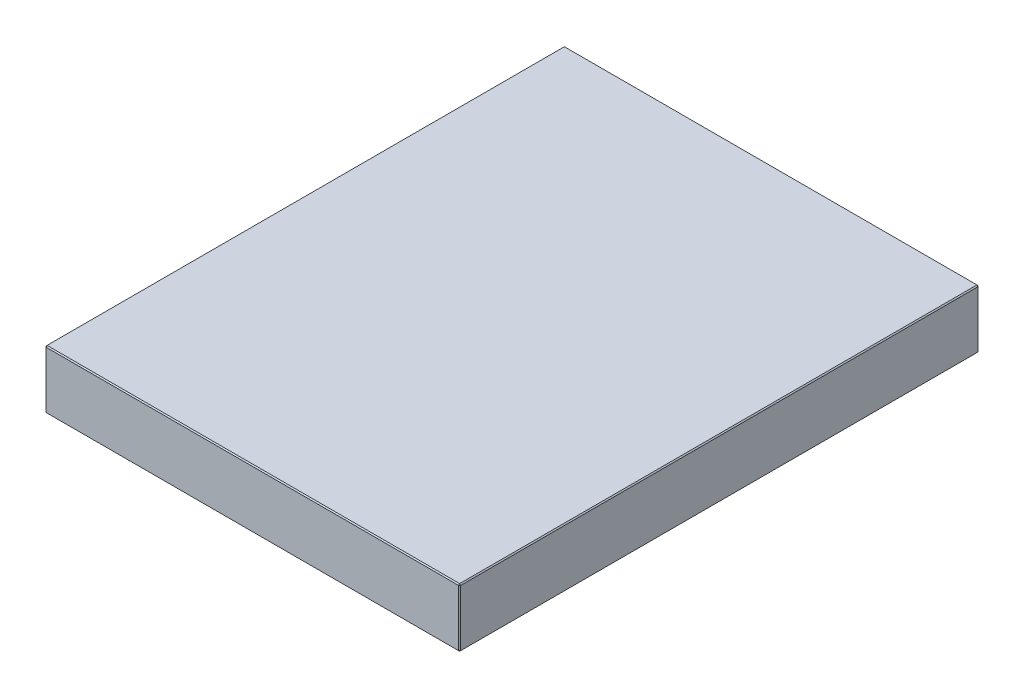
ISO-10303-21;
HEADER;
FILE_DESCRIPTION(('STEP AP214'),'2;1');
FILE_NAME('part.step','',(''),(''),'','','');
FILE_SCHEMA(('AUTOMOTIVE_DESIGN { 1 0 10303 214 1 1 1 1 }'));
ENDSEC;
DATA;
#1=APPLICATION_CONTEXT('core data for automotive mechanical design processes');
#2=APPLICATION_PROTOCOL_DEFINITION('international standard','automotive_design',2000,#1);
#3=PRODUCT_CONTEXT('',#1,'mechanical');
#4=PRODUCT('Part','Part','',(#3));
#5=PRODUCT_RELATED_PRODUCT_CATEGORY('part','',(#4));
#6=PRODUCT_DEFINITION_FORMATION('','',#4);
#7=PRODUCT_DEFINITION_CONTEXT('part definition',#1,'design');
#8=PRODUCT_DEFINITION('design','',#6,#7);
#9=PRODUCT_DEFINITION_SHAPE('','',#8);
#10=(LENGTH_UNIT() NAMED_UNIT(*) SI_UNIT(.MILLI.,.METRE.));
#11=(NAMED_UNIT(*) PLANE_ANGLE_UNIT() SI_UNIT($,.RADIAN.));
#12=(NAMED_UNIT(*) SI_UNIT($,.STERADIAN.) SOLID_ANGLE_UNIT());
#13=UNCERTAINTY_MEASURE_WITH_UNIT(LENGTH_MEASURE(1.E-05),#10,'distance_accuracy_value','');
#14=(GEOMETRIC_REPRESENTATION_CONTEXT(3) GLOBAL_UNCERTAINTY_ASSIGNED_CONTEXT((#13)) GLOBAL_UNIT_ASSIGNED_CONTEXT((#10,
#11,#12)) REPRESENTATION_CONTEXT('',''));
#15=CARTESIAN_POINT('',(0.,0.,0.));
#16=DIRECTION('',(0.,0.,1.));
#17=DIRECTION('',(1.,0.,0.));
#18=AXIS2_PLACEMENT_3D('',#15,#16,#17);
#19=CARTESIAN_POINT('',(-198.,56.,248.));
#20=DIRECTION('',(1.,0.,0.));
#21=DIRECTION('',(0.,0.,-1.));
#22=AXIS2_PLACEMENT_3D('',#19,#20,#21);
#23=PLANE('',#22);
#24=DIRECTION('',(0.,-1.,0.));
#25=VECTOR('',#24,1.);
#26=CARTESIAN_POINT('',(-198.,56.,-247.));
#27=LINE('',#26,#25);
#28=CARTESIAN_POINT('',(-198.,55.,-247.));
#29=VERTEX_POINT('',#28);
#30=CARTESIAN_POINT('',(-198.,1.00000000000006,-247.));
#31=VERTEX_POINT('',#30);
#32=EDGE_CURVE('E114',#29,#31,#27,.T.);
#33=ORIENTED_EDGE('',*,*,#32,.T.);
#34=DIRECTION('',(0.,0.,1.));
#35=VECTOR('',#34,1.);
#36=CARTESIAN_POINT('',(-198.,1.00000000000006,248.));
#37=LINE('',#36,#35);
#38=CARTESIAN_POINT('',(-198.,1.00000000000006,247.));
#39=VERTEX_POINT('',#38);
#40=EDGE_CURVE('E110',#31,#39,#37,.T.);
#41=ORIENTED_EDGE('',*,*,#40,.T.);
#42=DIRECTION('',(0.,1.,0.));
#43=VECTOR('',#42,1.);
#44=CARTESIAN_POINT('',(-198.,56.,247.));
#45=LINE('',#44,#43);
#46=CARTESIAN_POINT('',(-198.,55.,247.));
#47=VERTEX_POINT('',#46);
#48=EDGE_CURVE('E103',#39,#47,#45,.T.);
#49=ORIENTED_EDGE('',*,*,#48,.T.);
#50=DIRECTION('',(0.,0.,-1.));
#51=VECTOR('',#50,1.);
#52=CARTESIAN_POINT('',(-198.,55.,-248.));
#53=LINE('',#52,#51);
#54=EDGE_CURVE('E107',#47,#29,#53,.T.);
#55=ORIENTED_EDGE('',*,*,#54,.T.);
#56=EDGE_LOOP('',(#33,#41,#49,#55));
#57=FACE_BOUND('',#56,.T.);
#58=ADVANCED_FACE('F15',(#57),#23,.F.);
#59=CARTESIAN_POINT('',(198.,56.,248.));
#60=DIRECTION('',(0.,0.,-1.));
#61=DIRECTION('',(-1.,0.,0.));
#62=AXIS2_PLACEMENT_3D('',#59,#60,#61);
#63=PLANE('',#62);
#64=DIRECTION('',(-1.,0.,0.));
#65=VECTOR('',#64,1.);
#66=CARTESIAN_POINT('',(-198.,55.,248.));
#67=LINE('',#66,#65);
#68=CARTESIAN_POINT('',(197.,55.,248.));
#69=VERTEX_POINT('',#68);
#70=CARTESIAN_POINT('',(-197.,55.,248.));
#71=VERTEX_POINT('',#70);
#72=EDGE_CURVE('E164',#69,#71,#67,.T.);
#73=ORIENTED_EDGE('',*,*,#72,.T.);
#74=DIRECTION('',(0.,-1.,0.));
#75=VECTOR('',#74,1.);
#76=CARTESIAN_POINT('',(-197.,56.,248.));
#77=LINE('',#76,#75);
#78=CARTESIAN_POINT('',(-197.,1.00000000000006,248.));
#79=VERTEX_POINT('',#78);
#80=EDGE_CURVE('E122',#71,#79,#77,.T.);
#81=ORIENTED_EDGE('',*,*,#80,.T.);
#82=DIRECTION('',(1.,0.,0.));
#83=VECTOR('',#82,1.);
#84=CARTESIAN_POINT('',(198.,1.00000000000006,248.));
#85=LINE('',#84,#83);
#86=CARTESIAN_POINT('',(197.,1.00000000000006,248.));
#87=VERTEX_POINT('',#86);
#88=EDGE_CURVE('E168',#79,#87,#85,.T.);
#89=ORIENTED_EDGE('',*,*,#88,.T.);
#90=DIRECTION('',(0.,1.,0.));
#91=VECTOR('',#90,1.);
#92=CARTESIAN_POINT('',(197.,56.,248.));
#93=LINE('',#92,#91);
#94=EDGE_CURVE('E166',#87,#69,#93,.T.);
#95=ORIENTED_EDGE('',*,*,#94,.T.);
#96=EDGE_LOOP('',(#73,#81,#89,#95));
#97=FACE_BOUND('',#96,.T.);
#98=ADVANCED_FACE('F275',(#97),#63,.F.);
#99=CARTESIAN_POINT('',(198.,56.,248.));
#100=DIRECTION('',(-1.,0.,0.));
#101=DIRECTION('',(0.,0.,1.));
#102=AXIS2_PLACEMENT_3D('',#99,#100,#101);
#103=PLANE('',#102);
#104=DIRECTION('',(0.,0.,-1.));
#105=VECTOR('',#104,1.);
#106=CARTESIAN_POINT('',(198.,1.00000000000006,248.));
#107=LINE('',#106,#105);
#108=CARTESIAN_POINT('',(198.,1.00000000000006,247.));
#109=VERTEX_POINT('',#108);
#110=CARTESIAN_POINT('',(198.,1.00000000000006,-247.));
#111=VERTEX_POINT('',#110);
#112=EDGE_CURVE('E159',#109,#111,#107,.T.);
#113=ORIENTED_EDGE('',*,*,#112,.T.);
#114=DIRECTION('',(0.,1.,0.));
#115=VECTOR('',#114,1.);
#116=CARTESIAN_POINT('',(198.,56.,-247.));
#117=LINE('',#116,#115);
#118=CARTESIAN_POINT('',(198.,55.,-247.));
#119=VERTEX_POINT('',#118);
#120=EDGE_CURVE('E161',#111,#119,#117,.T.);
#121=ORIENTED_EDGE('',*,*,#120,.T.);
#122=DIRECTION('',(0.,0.,1.));
#123=VECTOR('',#122,1.);
#124=CARTESIAN_POINT('',(198.,55.,248.));
#125=LINE('',#124,#123);
#126=CARTESIAN_POINT('',(198.,55.,247.));
#127=VERTEX_POINT('',#126);
#128=EDGE_CURVE('E155',#119,#127,#125,.T.);
#129=ORIENTED_EDGE('',*,*,#128,.T.);
#130=DIRECTION('',(0.,-1.,0.));
#131=VECTOR('',#130,1.);
#132=CARTESIAN_POINT('',(198.,56.,247.));
#133=LINE('',#132,#131);
#134=EDGE_CURVE('E157',#127,#109,#133,.T.);
#135=ORIENTED_EDGE('',*,*,#134,.T.);
#136=EDGE_LOOP('',(#113,#121,#129,#135));
#137=FACE_BOUND('',#136,.T.);
#138=ADVANCED_FACE('F254',(#137),#103,.F.);
#139=CARTESIAN_POINT('',(198.,56.,-248.));
#140=DIRECTION('',(0.,0.,1.));
#141=DIRECTION('',(1.,0.,0.));
#142=AXIS2_PLACEMENT_3D('',#139,#140,#141);
#143=PLANE('',#142);
#144=DIRECTION('',(0.,-1.,0.));
#145=VECTOR('',#144,1.);
#146=CARTESIAN_POINT('',(197.,56.,-248.));
#147=LINE('',#146,#145);
#148=CARTESIAN_POINT('',(197.,55.,-248.));
#149=VERTEX_POINT('',#148);
#150=CARTESIAN_POINT('',(197.,1.00000000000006,-248.));
#151=VERTEX_POINT('',#150);
#152=EDGE_CURVE('E148',#149,#151,#147,.T.);
#153=ORIENTED_EDGE('',*,*,#152,.T.);
#154=DIRECTION('',(-1.,0.,0.));
#155=VECTOR('',#154,1.);
#156=CARTESIAN_POINT('',(198.,1.00000000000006,-248.));
#157=LINE('',#156,#155);
#158=CARTESIAN_POINT('',(-197.,1.00000000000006,-248.));
#159=VERTEX_POINT('',#158);
#160=EDGE_CURVE('E153',#151,#159,#157,.T.);
#161=ORIENTED_EDGE('',*,*,#160,.T.);
#162=DIRECTION('',(0.,1.,0.));
#163=VECTOR('',#162,1.);
#164=CARTESIAN_POINT('',(-197.,56.,-248.));
#165=LINE('',#164,#163);
#166=CARTESIAN_POINT('',(-197.,55.,-248.));
#167=VERTEX_POINT('',#166);
#168=EDGE_CURVE('E150',#159,#167,#165,.T.);
#169=ORIENTED_EDGE('',*,*,#168,.T.);
#170=DIRECTION('',(1.,0.,0.));
#171=VECTOR('',#170,1.);
#172=CARTESIAN_POINT('',(198.,55.,-248.));
#173=LINE('',#172,#171);
#174=EDGE_CURVE('E146',#167,#149,#173,.T.);
#175=ORIENTED_EDGE('',*,*,#174,.T.);
#176=EDGE_LOOP('',(#153,#161,#169,#175));
#177=FACE_BOUND('',#176,.T.);
#178=ADVANCED_FACE('F284',(#177),#143,.F.);
#179=CARTESIAN_POINT('',(0.,56.,0.));
#180=DIRECTION('',(0.,1.,0.));
#181=DIRECTION('',(0.,0.,1.));
#182=AXIS2_PLACEMENT_3D('',#179,#180,#181);
#183=PLANE('',#182);
#184=DIRECTION('',(0.,0.,-1.));
#185=VECTOR('',#184,1.);
#186=CARTESIAN_POINT('',(197.,56.,-248.));
#187=LINE('',#186,#185);
#188=CARTESIAN_POINT('',(197.,56.,247.));
#189=VERTEX_POINT('',#188);
#190=CARTESIAN_POINT('',(197.,56.,-247.));
#191=VERTEX_POINT('',#190);
#192=EDGE_CURVE('E24',#189,#191,#187,.T.);
#193=ORIENTED_EDGE('',*,*,#192,.T.);
#194=DIRECTION('',(-1.,0.,0.));
#195=VECTOR('',#194,1.);
#196=CARTESIAN_POINT('',(-198.,56.,-247.));
#197=LINE('',#196,#195);
#198=CARTESIAN_POINT('',(-197.,56.,-247.));
#199=VERTEX_POINT('',#198);
#200=EDGE_CURVE('E9',#191,#199,#197,.T.);
#201=ORIENTED_EDGE('',*,*,#200,.T.);
#202=DIRECTION('',(0.,0.,1.));
#203=VECTOR('',#202,1.);
#204=CARTESIAN_POINT('',(-197.,56.,248.));
#205=LINE('',#204,#203);
#206=CARTESIAN_POINT('',(-197.,56.,247.));
#207=VERTEX_POINT('',#206);
#208=EDGE_CURVE('E180',#199,#207,#205,.T.);
#209=ORIENTED_EDGE('',*,*,#208,.T.);
#210=DIRECTION('',(1.,0.,0.));
#211=VECTOR('',#210,1.);
#212=CARTESIAN_POINT('',(198.,56.,247.));
#213=LINE('',#212,#211);
#214=EDGE_CURVE('E35',#207,#189,#213,.T.);
#215=ORIENTED_EDGE('',*,*,#214,.T.);
#216=EDGE_LOOP('',(#193,#201,#209,#215));
#217=FACE_BOUND('',#216,.T.);
#218=ADVANCED_FACE('F350',(#217),#183,.T.);
#219=CARTESIAN_POINT('',(0.,0.,0.));
#220=DIRECTION('',(0.,1.,0.));
#221=DIRECTION('',(0.,0.,1.));
#222=AXIS2_PLACEMENT_3D('',#219,#220,#221);
#223=PLANE('',#222);
#224=DIRECTION('',(0.,0.,1.));
#225=VECTOR('',#224,1.);
#226=CARTESIAN_POINT('',(197.,0.,0.));
#227=LINE('',#226,#225);
#228=CARTESIAN_POINT('',(197.,0.,-247.));
#229=VERTEX_POINT('',#228);
#230=CARTESIAN_POINT('',(197.,0.,247.));
#231=VERTEX_POINT('',#230);
#232=EDGE_CURVE('E171',#229,#231,#227,.T.);
#233=ORIENTED_EDGE('',*,*,#232,.T.);
#234=DIRECTION('',(-1.,0.,0.));
#235=VECTOR('',#234,1.);
#236=CARTESIAN_POINT('',(0.,0.,247.));
#237=LINE('',#236,#235);
#238=CARTESIAN_POINT('',(-197.,0.,247.));
#239=VERTEX_POINT('',#238);
#240=EDGE_CURVE('E177',#231,#239,#237,.T.);
#241=ORIENTED_EDGE('',*,*,#240,.T.);
#242=DIRECTION('',(0.,0.,-1.));
#243=VECTOR('',#242,1.);
#244=CARTESIAN_POINT('',(-197.,0.,0.));
#245=LINE('',#244,#243);
#246=CARTESIAN_POINT('',(-197.,0.,-247.));
#247=VERTEX_POINT('',#246);
#248=EDGE_CURVE('E175',#239,#247,#245,.T.);
#249=ORIENTED_EDGE('',*,*,#248,.T.);
#250=DIRECTION('',(1.,0.,0.));
#251=VECTOR('',#250,1.);
#252=CARTESIAN_POINT('',(0.,0.,-247.));
#253=LINE('',#252,#251);
#254=EDGE_CURVE('E173',#247,#229,#253,.T.);
#255=ORIENTED_EDGE('',*,*,#254,.T.);
#256=EDGE_LOOP('',(#233,#241,#249,#255));
#257=FACE_BOUND('',#256,.T.);
#258=ADVANCED_FACE('F246',(#257),#223,.F.);
#259=CARTESIAN_POINT('',(198.,56.,247.));
#260=DIRECTION('',(-0.707106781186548,0.,-0.707106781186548));
#261=DIRECTION('',(0.,-1.,0.));
#262=AXIS2_PLACEMENT_3D('',#259,#260,#261);
#263=PLANE('',#262);
#264=DIRECTION('',(-0.707106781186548,0.,0.707106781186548));
#265=VECTOR('',#264,1.);
#266=CARTESIAN_POINT('',(197.,55.,248.));
#267=LINE('',#266,#265);
#268=EDGE_CURVE('E19',#69,#127,#267,.F.);
#269=ORIENTED_EDGE('',*,*,#268,.F.);
#270=ORIENTED_EDGE('',*,*,#94,.F.);
#271=DIRECTION('',(0.707106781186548,0.,-0.707106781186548));
#272=VECTOR('',#271,1.);
#273=CARTESIAN_POINT('',(197.,1.00000000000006,248.));
#274=LINE('',#273,#272);
#275=EDGE_CURVE('E142',#109,#87,#274,.F.);
#276=ORIENTED_EDGE('',*,*,#275,.F.);
#277=ORIENTED_EDGE('',*,*,#134,.F.);
#278=EDGE_LOOP('',(#269,#270,#276,#277));
#279=FACE_BOUND('',#278,.T.);
#280=ADVANCED_FACE('F17',(#279),#263,.F.);
#281=CARTESIAN_POINT('',(197.,55.,248.));
#282=DIRECTION('',(0.577350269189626,0.577350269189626,0.577350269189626));
#283=DIRECTION('',(0.707106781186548,0.,-0.707106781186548));
#284=AXIS2_PLACEMENT_3D('',#281,#282,#283);
#285=PLANE('',#284);
#286=DIRECTION('',(0.,-0.707106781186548,0.707106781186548));
#287=VECTOR('',#286,1.);
#288=CARTESIAN_POINT('',(197.,55.,248.));
#289=LINE('',#288,#287);
#290=EDGE_CURVE('E226',#69,#189,#289,.F.);
#291=ORIENTED_EDGE('',*,*,#290,.F.);
#292=ORIENTED_EDGE('',*,*,#268,.T.);
#293=DIRECTION('',(-0.707106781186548,0.707106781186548,0.));
#294=VECTOR('',#293,1.);
#295=CARTESIAN_POINT('',(197.5,55.5,247.));
#296=LINE('',#295,#294);
#297=EDGE_CURVE('E228',#189,#127,#296,.F.);
#298=ORIENTED_EDGE('',*,*,#297,.F.);
#299=EDGE_LOOP('',(#291,#292,#298));
#300=FACE_BOUND('',#299,.T.);
#301=ADVANCED_FACE('F270',(#300),#285,.T.);
#302=CARTESIAN_POINT('',(197.,1.00000000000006,248.));
#303=DIRECTION('',(0.577350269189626,-0.577350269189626,0.577350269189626));
#304=DIRECTION('',(0.707106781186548,0.,-0.707106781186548));
#305=AXIS2_PLACEMENT_3D('',#302,#303,#304);
#306=PLANE('',#305);
#307=DIRECTION('',(-0.707106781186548,-0.707106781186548,0.));
#308=VECTOR('',#307,1.);
#309=CARTESIAN_POINT('',(197.5,0.500000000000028,247.));
#310=LINE('',#309,#308);
#311=EDGE_CURVE('E220',#109,#231,#310,.T.);
#312=ORIENTED_EDGE('',*,*,#311,.F.);
#313=ORIENTED_EDGE('',*,*,#275,.T.);
#314=DIRECTION('',(0.,0.707106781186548,0.707106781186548));
#315=VECTOR('',#314,1.);
#316=CARTESIAN_POINT('',(197.,1.00000000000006,248.));
#317=LINE('',#316,#315);
#318=EDGE_CURVE('E223',#231,#87,#317,.T.);
#319=ORIENTED_EDGE('',*,*,#318,.F.);
#320=EDGE_LOOP('',(#312,#313,#319));
#321=FACE_BOUND('',#320,.T.);
#322=ADVANCED_FACE('F235',(#321),#306,.T.);
#323=CARTESIAN_POINT('',(197.,56.,0.));
#324=DIRECTION('',(0.707106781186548,0.707106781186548,0.));
#325=DIRECTION('',(0.,0.,1.));
#326=AXIS2_PLACEMENT_3D('',#323,#324,#325);
#327=PLANE('',#326);
#328=ORIENTED_EDGE('',*,*,#297,.T.);
#329=ORIENTED_EDGE('',*,*,#128,.F.);
#330=DIRECTION('',(0.707106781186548,-0.707106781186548,0.));
#331=VECTOR('',#330,1.);
#332=CARTESIAN_POINT('',(198.,55.,-247.));
#333=LINE('',#332,#331);
#334=EDGE_CURVE('E215',#191,#119,#333,.T.);
#335=ORIENTED_EDGE('',*,*,#334,.F.);
#336=ORIENTED_EDGE('',*,*,#192,.F.);
#337=EDGE_LOOP('',(#328,#329,#335,#336));
#338=FACE_BOUND('',#337,.T.);
#339=ADVANCED_FACE('F265',(#338),#327,.T.);
#340=CARTESIAN_POINT('',(0.,56.,247.));
#341=DIRECTION('',(0.,0.707106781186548,0.707106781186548));
#342=DIRECTION('',(-1.,0.,0.));
#343=AXIS2_PLACEMENT_3D('',#340,#341,#342);
#344=PLANE('',#343);
#345=ORIENTED_EDGE('',*,*,#290,.T.);
#346=ORIENTED_EDGE('',*,*,#214,.F.);
#347=DIRECTION('',(0.,0.707106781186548,-0.707106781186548));
#348=VECTOR('',#347,1.);
#349=CARTESIAN_POINT('',(-197.,55.5,247.5));
#350=LINE('',#349,#348);
#351=EDGE_CURVE('E126',#71,#207,#350,.T.);
#352=ORIENTED_EDGE('',*,*,#351,.F.);
#353=ORIENTED_EDGE('',*,*,#72,.F.);
#354=EDGE_LOOP('',(#345,#346,#352,#353));
#355=FACE_BOUND('',#354,.T.);
#356=ADVANCED_FACE('F273',(#355),#344,.T.);
#357=CARTESIAN_POINT('',(-197.,56.,248.));
#358=DIRECTION('',(0.707106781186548,0.,-0.707106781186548));
#359=DIRECTION('',(0.,-1.,0.));
#360=AXIS2_PLACEMENT_3D('',#357,#358,#359);
#361=PLANE('',#360);
#362=DIRECTION('',(0.707106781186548,0.,0.707106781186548));
#363=VECTOR('',#362,1.);
#364=CARTESIAN_POINT('',(-197.,1.00000000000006,248.));
#365=LINE('',#364,#363);
#366=EDGE_CURVE('E127',#79,#39,#365,.F.);
#367=ORIENTED_EDGE('',*,*,#366,.F.);
#368=ORIENTED_EDGE('',*,*,#80,.F.);
#369=DIRECTION('',(-0.707106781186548,0.,-0.707106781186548));
#370=VECTOR('',#369,1.);
#371=CARTESIAN_POINT('',(-198.,55.,247.));
#372=LINE('',#371,#370);
#373=EDGE_CURVE('E118',#47,#71,#372,.F.);
#374=ORIENTED_EDGE('',*,*,#373,.F.);
#375=ORIENTED_EDGE('',*,*,#48,.F.);
#376=EDGE_LOOP('',(#367,#368,#374,#375));
#377=FACE_BOUND('',#376,.T.);
#378=ADVANCED_FACE('F120',(#377),#361,.F.);
#379=CARTESIAN_POINT('',(198.,1.00000000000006,248.));
#380=DIRECTION('',(0.,0.707106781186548,-0.707106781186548));
#381=DIRECTION('',(1.,0.,0.));
#382=AXIS2_PLACEMENT_3D('',#379,#380,#381);
#383=PLANE('',#382);
#384=ORIENTED_EDGE('',*,*,#318,.T.);
#385=ORIENTED_EDGE('',*,*,#88,.F.);
#386=DIRECTION('',(0.,-0.707106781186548,-0.707106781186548));
#387=VECTOR('',#386,1.);
#388=CARTESIAN_POINT('',(-197.,1.00000000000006,248.));
#389=LINE('',#388,#387);
#390=EDGE_CURVE('E211',#239,#79,#389,.F.);
#391=ORIENTED_EDGE('',*,*,#390,.F.);
#392=ORIENTED_EDGE('',*,*,#240,.F.);
#393=EDGE_LOOP('',(#384,#385,#391,#392));
#394=FACE_BOUND('',#393,.T.);
#395=ADVANCED_FACE('F243',(#394),#383,.F.);
#396=CARTESIAN_POINT('',(198.,1.00000000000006,248.));
#397=DIRECTION('',(-0.707106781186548,0.707106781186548,0.));
#398=DIRECTION('',(0.,0.,-1.));
#399=AXIS2_PLACEMENT_3D('',#396,#397,#398);
#400=PLANE('',#399);
#401=ORIENTED_EDGE('',*,*,#311,.T.);
#402=ORIENTED_EDGE('',*,*,#232,.F.);
#403=DIRECTION('',(0.707106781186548,0.707106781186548,0.));
#404=VECTOR('',#403,1.);
#405=CARTESIAN_POINT('',(197.5,0.500000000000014,-247.));
#406=LINE('',#405,#404);
#407=EDGE_CURVE('E208',#111,#229,#406,.F.);
#408=ORIENTED_EDGE('',*,*,#407,.F.);
#409=ORIENTED_EDGE('',*,*,#112,.F.);
#410=EDGE_LOOP('',(#401,#402,#408,#409));
#411=FACE_BOUND('',#410,.T.);
#412=ADVANCED_FACE('F251',(#411),#400,.F.);
#413=CARTESIAN_POINT('',(197.,56.,-248.));
#414=DIRECTION('',(-0.707106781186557,0.,0.707106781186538));
#415=DIRECTION('',(0.,-1.,0.));
#416=AXIS2_PLACEMENT_3D('',#413,#414,#415);
#417=PLANE('',#416);
#418=DIRECTION('',(0.707106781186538,0.,0.707106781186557));
#419=VECTOR('',#418,1.);
#420=CARTESIAN_POINT('',(198.,55.,-247.));
#421=LINE('',#420,#419);
#422=EDGE_CURVE('E217',#119,#149,#421,.F.);
#423=ORIENTED_EDGE('',*,*,#422,.F.);
#424=ORIENTED_EDGE('',*,*,#120,.F.);
#425=DIRECTION('',(-0.707106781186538,0.,-0.707106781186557));
#426=VECTOR('',#425,1.);
#427=CARTESIAN_POINT('',(197.,1.00000000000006,-248.));
#428=LINE('',#427,#426);
#429=EDGE_CURVE('E205',#151,#111,#428,.F.);
#430=ORIENTED_EDGE('',*,*,#429,.F.);
#431=ORIENTED_EDGE('',*,*,#152,.F.);
#432=EDGE_LOOP('',(#423,#424,#430,#431));
#433=FACE_BOUND('',#432,.T.);
#434=ADVANCED_FACE('F258',(#433),#417,.F.);
#435=CARTESIAN_POINT('',(198.,55.,-247.));
#436=DIRECTION('',(0.577350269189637,0.57735026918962,-0.57735026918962));
#437=DIRECTION('',(-0.707106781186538,0.,-0.707106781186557));
#438=AXIS2_PLACEMENT_3D('',#435,#436,#437);
#439=PLANE('',#438);
#440=ORIENTED_EDGE('',*,*,#334,.T.);
#441=ORIENTED_EDGE('',*,*,#422,.T.);
#442=DIRECTION('',(0.,0.707106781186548,0.707106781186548));
#443=VECTOR('',#442,1.);
#444=CARTESIAN_POINT('',(197.,55.5,-247.5));
#445=LINE('',#444,#443);
#446=EDGE_CURVE('E134',#191,#149,#445,.F.);
#447=ORIENTED_EDGE('',*,*,#446,.F.);
#448=EDGE_LOOP('',(#440,#441,#447));
#449=FACE_BOUND('',#448,.T.);
#450=ADVANCED_FACE('F325',(#449),#439,.T.);
#451=CARTESIAN_POINT('',(-198.,55.,247.));
#452=DIRECTION('',(-0.577350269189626,0.577350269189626,0.577350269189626));
#453=DIRECTION('',(0.707106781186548,0.,0.707106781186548));
#454=AXIS2_PLACEMENT_3D('',#451,#452,#453);
#455=PLANE('',#454);
#456=ORIENTED_EDGE('',*,*,#373,.T.);
#457=ORIENTED_EDGE('',*,*,#351,.T.);
#458=DIRECTION('',(-0.707106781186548,-0.707106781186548,0.));
#459=VECTOR('',#458,1.);
#460=CARTESIAN_POINT('',(-198.,55.,247.));
#461=LINE('',#460,#459);
#462=EDGE_CURVE('E130',#47,#207,#461,.F.);
#463=ORIENTED_EDGE('',*,*,#462,.F.);
#464=EDGE_LOOP('',(#456,#457,#463));
#465=FACE_BOUND('',#464,.T.);
#466=ADVANCED_FACE('F131',(#465),#455,.T.);
#467=CARTESIAN_POINT('',(-197.,1.00000000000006,248.));
#468=DIRECTION('',(-0.577350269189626,-0.577350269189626,0.577350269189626));
#469=DIRECTION('',(0.707106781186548,0.,0.707106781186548));
#470=AXIS2_PLACEMENT_3D('',#467,#468,#469);
#471=PLANE('',#470);
#472=ORIENTED_EDGE('',*,*,#390,.T.);
#473=ORIENTED_EDGE('',*,*,#366,.T.);
#474=DIRECTION('',(-0.707106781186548,0.707106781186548,0.));
#475=VECTOR('',#474,1.);
#476=CARTESIAN_POINT('',(-197.5,0.500000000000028,247.));
#477=LINE('',#476,#475);
#478=EDGE_CURVE('E135',#239,#39,#477,.T.);
#479=ORIENTED_EDGE('',*,*,#478,.F.);
#480=EDGE_LOOP('',(#472,#473,#479));
#481=FACE_BOUND('',#480,.T.);
#482=ADVANCED_FACE('F318',(#481),#471,.T.);
#483=CARTESIAN_POINT('',(197.,1.00000000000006,-248.));
#484=DIRECTION('',(0.577350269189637,-0.57735026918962,-0.57735026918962));
#485=DIRECTION('',(-0.707106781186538,0.,-0.707106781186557));
#486=AXIS2_PLACEMENT_3D('',#483,#484,#485);
#487=PLANE('',#486);
#488=ORIENTED_EDGE('',*,*,#429,.T.);
#489=ORIENTED_EDGE('',*,*,#407,.T.);
#490=DIRECTION('',(0.,-0.707106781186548,0.707106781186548));
#491=VECTOR('',#490,1.);
#492=CARTESIAN_POINT('',(197.,1.00000000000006,-248.));
#493=LINE('',#492,#491);
#494=EDGE_CURVE('E198',#151,#229,#493,.T.);
#495=ORIENTED_EDGE('',*,*,#494,.F.);
#496=EDGE_LOOP('',(#488,#489,#495));
#497=FACE_BOUND('',#496,.T.);
#498=ADVANCED_FACE('F314',(#497),#487,.T.);
#499=CARTESIAN_POINT('',(0.,56.,-247.));
#500=DIRECTION('',(0.,0.707106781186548,-0.707106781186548));
#501=DIRECTION('',(1.,0.,0.));
#502=AXIS2_PLACEMENT_3D('',#499,#500,#501);
#503=PLANE('',#502);
#504=ORIENTED_EDGE('',*,*,#446,.T.);
#505=ORIENTED_EDGE('',*,*,#174,.F.);
#506=DIRECTION('',(0.,-0.707106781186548,-0.707106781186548));
#507=VECTOR('',#506,1.);
#508=CARTESIAN_POINT('',(-197.,55.,-248.));
#509=LINE('',#508,#507);
#510=EDGE_CURVE('E195',#199,#167,#509,.T.);
#511=ORIENTED_EDGE('',*,*,#510,.F.);
#512=ORIENTED_EDGE('',*,*,#200,.F.);
#513=EDGE_LOOP('',(#504,#505,#511,#512));
#514=FACE_BOUND('',#513,.T.);
#515=ADVANCED_FACE('F311',(#514),#503,.T.);
#516=CARTESIAN_POINT('',(-197.,56.,0.));
#517=DIRECTION('',(-0.707106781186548,0.707106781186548,0.));
#518=DIRECTION('',(0.,0.,-1.));
#519=AXIS2_PLACEMENT_3D('',#516,#517,#518);
#520=PLANE('',#519);
#521=ORIENTED_EDGE('',*,*,#462,.T.);
#522=ORIENTED_EDGE('',*,*,#208,.F.);
#523=DIRECTION('',(0.707106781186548,0.707106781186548,0.));
#524=VECTOR('',#523,1.);
#525=CARTESIAN_POINT('',(-197.5,55.5,-247.));
#526=LINE('',#525,#524);
#527=EDGE_CURVE('E138',#29,#199,#526,.T.);
#528=ORIENTED_EDGE('',*,*,#527,.F.);
#529=ORIENTED_EDGE('',*,*,#54,.F.);
#530=EDGE_LOOP('',(#521,#522,#528,#529));
#531=FACE_BOUND('',#530,.T.);
#532=ADVANCED_FACE('F137',(#531),#520,.T.);
#533=CARTESIAN_POINT('',(-198.,1.00000000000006,248.));
#534=DIRECTION('',(0.707106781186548,0.707106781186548,0.));
#535=DIRECTION('',(0.,0.,1.));
#536=AXIS2_PLACEMENT_3D('',#533,#534,#535);
#537=PLANE('',#536);
#538=ORIENTED_EDGE('',*,*,#478,.T.);
#539=ORIENTED_EDGE('',*,*,#40,.F.);
#540=DIRECTION('',(0.707106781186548,-0.707106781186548,0.));
#541=VECTOR('',#540,1.);
#542=CARTESIAN_POINT('',(-198.,1.00000000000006,-247.));
#543=LINE('',#542,#541);
#544=EDGE_CURVE('E191',#247,#31,#543,.F.);
#545=ORIENTED_EDGE('',*,*,#544,.F.);
#546=ORIENTED_EDGE('',*,*,#248,.F.);
#547=EDGE_LOOP('',(#538,#539,#545,#546));
#548=FACE_BOUND('',#547,.T.);
#549=ADVANCED_FACE('F304',(#548),#537,.F.);
#550=CARTESIAN_POINT('',(198.,1.00000000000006,-248.));
#551=DIRECTION('',(0.,0.707106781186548,0.707106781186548));
#552=DIRECTION('',(-1.,0.,0.));
#553=AXIS2_PLACEMENT_3D('',#550,#551,#552);
#554=PLANE('',#553);
#555=ORIENTED_EDGE('',*,*,#494,.T.);
#556=ORIENTED_EDGE('',*,*,#254,.F.);
#557=DIRECTION('',(0.,0.707106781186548,-0.707106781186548));
#558=VECTOR('',#557,1.);
#559=CARTESIAN_POINT('',(-197.,0.500000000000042,-247.5));
#560=LINE('',#559,#558);
#561=EDGE_CURVE('E188',#159,#247,#560,.F.);
#562=ORIENTED_EDGE('',*,*,#561,.F.);
#563=ORIENTED_EDGE('',*,*,#160,.F.);
#564=EDGE_LOOP('',(#555,#556,#562,#563));
#565=FACE_BOUND('',#564,.T.);
#566=ADVANCED_FACE('F300',(#565),#554,.F.);
#567=CARTESIAN_POINT('',(-197.,55.,-248.));
#568=DIRECTION('',(-0.577350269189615,0.577350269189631,-0.577350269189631));
#569=DIRECTION('',(0.,0.707106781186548,0.707106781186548));
#570=AXIS2_PLACEMENT_3D('',#567,#568,#569);
#571=PLANE('',#570);
#572=ORIENTED_EDGE('',*,*,#527,.T.);
#573=ORIENTED_EDGE('',*,*,#510,.T.);
#574=DIRECTION('',(0.707106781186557,0.,-0.707106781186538));
#575=VECTOR('',#574,1.);
#576=CARTESIAN_POINT('',(-197.,55.,-248.));
#577=LINE('',#576,#575);
#578=EDGE_CURVE('E186',#29,#167,#577,.T.);
#579=ORIENTED_EDGE('',*,*,#578,.F.);
#580=EDGE_LOOP('',(#572,#573,#579));
#581=FACE_BOUND('',#580,.T.);
#582=ADVANCED_FACE('F296',(#581),#571,.T.);
#583=CARTESIAN_POINT('',(-198.,1.00000000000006,-247.));
#584=DIRECTION('',(-0.577350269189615,-0.577350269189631,-0.577350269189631));
#585=DIRECTION('',(0.,0.707106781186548,-0.707106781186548));
#586=AXIS2_PLACEMENT_3D('',#583,#584,#585);
#587=PLANE('',#586);
#588=ORIENTED_EDGE('',*,*,#561,.T.);
#589=ORIENTED_EDGE('',*,*,#544,.T.);
#590=DIRECTION('',(-0.707106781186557,0.,0.707106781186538));
#591=VECTOR('',#590,1.);
#592=CARTESIAN_POINT('',(-198.,1.00000000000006,-247.));
#593=LINE('',#592,#591);
#594=EDGE_CURVE('E184',#159,#31,#593,.T.);
#595=ORIENTED_EDGE('',*,*,#594,.F.);
#596=EDGE_LOOP('',(#588,#589,#595));
#597=FACE_BOUND('',#596,.T.);
#598=ADVANCED_FACE('F292',(#597),#587,.T.);
#599=CARTESIAN_POINT('',(-198.,56.,-247.));
#600=DIRECTION('',(0.707106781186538,0.,0.707106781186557));
#601=DIRECTION('',(0.,-1.,0.));
#602=AXIS2_PLACEMENT_3D('',#599,#600,#601);
#603=PLANE('',#602);
#604=ORIENTED_EDGE('',*,*,#578,.T.);
#605=ORIENTED_EDGE('',*,*,#168,.F.);
#606=ORIENTED_EDGE('',*,*,#594,.T.);
#607=ORIENTED_EDGE('',*,*,#32,.F.);
#608=EDGE_LOOP('',(#604,#605,#606,#607));
#609=FACE_BOUND('',#608,.T.);
#610=ADVANCED_FACE('F289',(#609),#603,.F.);
#611=CLOSED_SHELL('',(#58,#98,#138,#178,#218,#258,#280,#301,#322,#339,#356,#378,#395,#412,#434,
#450,#466,#482,#498,#515,#532,#549,#566,#582,#598,#610));
#612=MANIFOLD_SOLID_BREP('B1',#611);
#613=ADVANCED_BREP_SHAPE_REPRESENTATION('',(#18,#612),#14);
#614=SHAPE_DEFINITION_REPRESENTATION(#9,#613);
ENDSEC;
END-ISO-10303-21;
